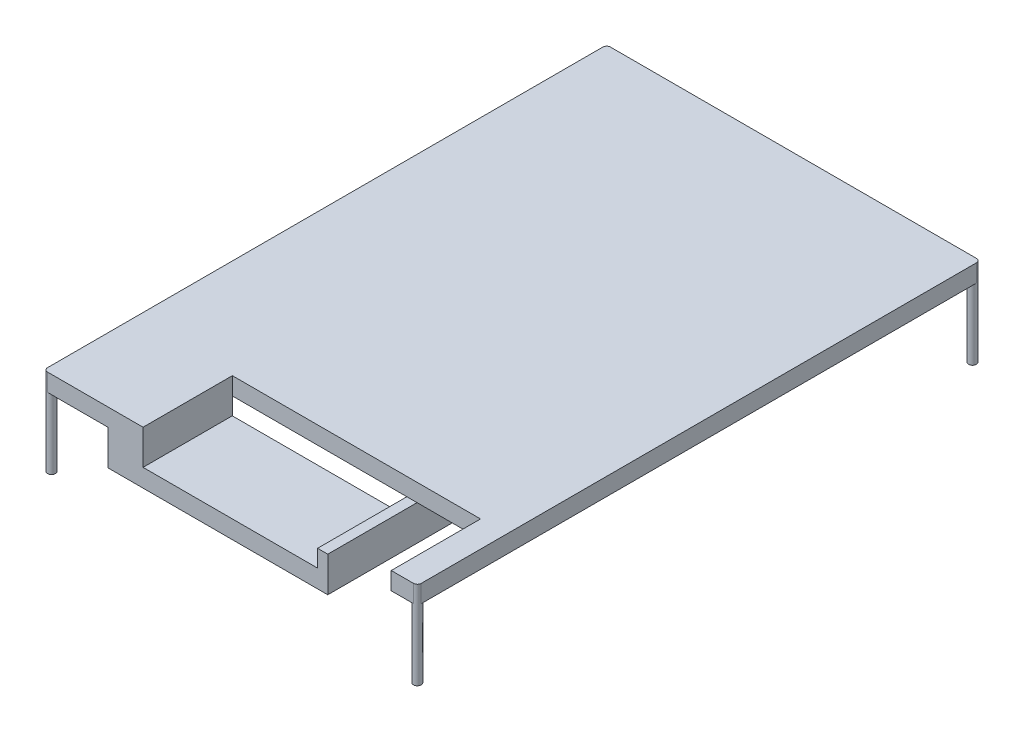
from build123d import *

# Parameters (mm, degrees)
SKETCH1_R             = 1.4
BOSS_EXTRUDE1_DEPTH   = 25.4
BOSS_EXTRUDE1_2_DEPTH = 25.4
BOSS_EXTRUDE2_DEPTH   = 6.35
SKETCH3_R             = 1.399999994
BOSS_EXTRUDE3_DEPTH   = 25.4
CUT_EXTRUDE1_START    = -25.4
CUT_EXTRUDE1_DEPTH    = 25.4
SKETCH6_W             = 89.588555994
SKETCH6_H             = 36.612073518
CUT_EXTRUDE2_DEPTH    = 216.126604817
SKETCH7_W             = 12.7
SKETCH7_H             = 32.208601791
BOSS_EXTRUDE4_DEPTH   = 12.7
SKETCH8_W             = 32.208601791
SKETCH8_H             = 6.5
BOSS_EXTRUDE5_DEPTH   = 63
SKETCH9_W             = 3.681330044
SKETCH9_H             = 48.939884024
BOSS_EXTRUDE6_DEPTH   = 12.7


with BuildPart() as part:
    # Sketch1 → Boss-Extrude1 (new body)
    with BuildSketch(Plane(origin=(0, 0, 0), x_dir=(1, 0, 0), z_dir=(0, 1, 0))):
        with Locations(Location((-66.04, 0, 0), (0, 0, 270))):
            Circle(SKETCH1_R)
    extrude(amount=BOSS_EXTRUDE1_DEPTH)



with BuildPart() as body_2:
    # Sketch1 → Boss-Extrude1 2 (new body)
    with BuildSketch(Plane(origin=(0, 0, 0), x_dir=(1, 0, 0), z_dir=(0, 1, 0))):
        with Locations(Location((66.04, 0, 0), (0, 0, 270))):
            Circle(SKETCH1_R)
    extrude(amount=BOSS_EXTRUDE1_2_DEPTH)


with BuildPart() as part_1:
    add(part.part)

    add(body_2.part)  # Boss-Extrude2 merges body 2
    # Sketch2 → Boss-Extrude2 (add)
    with BuildSketch(Plane(origin=(0, 25.4, 0), x_dir=(1, 0, 0), z_dir=(0, 1, 0))):
        with BuildLine():
            Line((-66.04, 1.4), (66.04, 1.4))
            ThreePointArc((66.04, 1.4), (67.029949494, 0.989949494), (67.44, 0))
            Line((67.44, 0), (67.44, -201.8))
            Line((67.44, -201.8), (-67.44, -201.8))
            Line((-67.44, -201.8), (-67.44, 0))
            ThreePointArc((-67.44, 0), (-67.029949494, 0.989949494), (-66.04, 1.4))
        make_face()
    extrude(amount=BOSS_EXTRUDE2_DEPTH)

    # Sketch3 → Boss-Extrude3 (add)
    with BuildSketch(Plane.XZ.offset(-25.4)):
        with Locations(Location((-66.040000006, 200.400000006, 0), (0, 0, 90))):
            Circle(SKETCH3_R)
        with Locations(Location((66.040000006, 200.400000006, 0), (0, 0, 90))):
            Circle(SKETCH3_R)
    extrude(amount=BOSS_EXTRUDE3_DEPTH)

    # Sketch5 → Cut-Extrude1 (cut)
    with BuildSketch(Plane.XZ.offset(-25.4).offset(CUT_EXTRUDE1_START)):
        with BuildLine():
            Line((-67.44, 200.400000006), (-67.44, 201.8))
            Line((-67.44, 201.8), (-66.040000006, 201.8))
            ThreePointArc((-66.040000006, 201.8), (-67.029949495, 201.389949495), (-67.44, 200.400000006))
        make_face()
        with BuildLine():
            Line((67.44, 201.8), (66.040000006, 201.8))
            ThreePointArc((66.040000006, 201.8), (67.029949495, 201.389949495), (67.44, 200.400000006))
            Line((67.44, 200.400000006), (67.44, 201.8))
        make_face()
    extrude(amount=CUT_EXTRUDE1_DEPTH, mode=Mode.SUBTRACT)

    # Sketch6 → Cut-Extrude2 (cut, through all)
    with BuildSketch(Plane(origin=(0, 31.75, 0), x_dir=(1, 0, 0), z_dir=(0, 1, 0))):
        with Locations((13.213425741, -187.874582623)):
            Rectangle(SKETCH6_W, SKETCH6_H)
    extrude(amount=-CUT_EXTRUDE2_DEPTH, mode=Mode.SUBTRACT)

    # Sketch7 → Boss-Extrude4 (add)
    with BuildSketch(Plane.XZ.offset(-25.4)):
        with Locations((-37.930852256, 185.695699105)):
            Rectangle(SKETCH7_W, SKETCH7_H)
    extrude(amount=BOSS_EXTRUDE4_DEPTH)

    # Sketch8 → Boss-Extrude5 (add)
    with BuildSketch(Plane(origin=(-31.580852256, 0, 0), x_dir=(0, 0, -1), z_dir=(1, 0, 0))):
        with Locations((-185.695699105, 15.95)):
            Rectangle(SKETCH8_W, SKETCH8_H)
    extrude(amount=BOSS_EXTRUDE5_DEPTH)

    # Sketch9 → Boss-Extrude6 (add)
    with BuildSketch(Plane.XZ.offset(-25.4)):
        with Locations((33.259812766, 177.330057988)):
            Rectangle(SKETCH9_W, SKETCH9_H)
    extrude(amount=BOSS_EXTRUDE6_DEPTH)


solid = part_1.part
